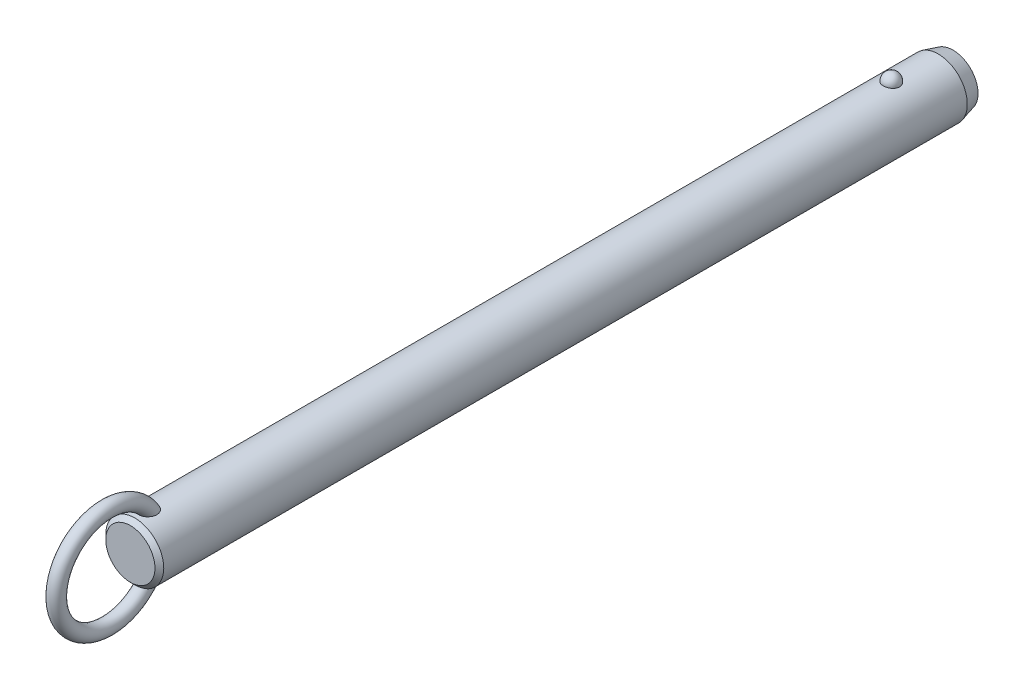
ISO-10303-21;
HEADER;
FILE_DESCRIPTION(('STEP AP214'),'2;1');
FILE_NAME('part.step','',(''),(''),'','','');
FILE_SCHEMA(('AUTOMOTIVE_DESIGN { 1 0 10303 214 1 1 1 1 }'));
ENDSEC;
DATA;
#1=APPLICATION_CONTEXT('core data for automotive mechanical design processes');
#2=APPLICATION_PROTOCOL_DEFINITION('international standard','automotive_design',2000,#1);
#3=PRODUCT_CONTEXT('',#1,'mechanical');
#4=PRODUCT('Part','Part','',(#3));
#5=PRODUCT_RELATED_PRODUCT_CATEGORY('part','',(#4));
#6=PRODUCT_DEFINITION_FORMATION('','',#4);
#7=PRODUCT_DEFINITION_CONTEXT('part definition',#1,'design');
#8=PRODUCT_DEFINITION('design','',#6,#7);
#9=PRODUCT_DEFINITION_SHAPE('','',#8);
#10=(LENGTH_UNIT() NAMED_UNIT(*) SI_UNIT(.MILLI.,.METRE.));
#11=(NAMED_UNIT(*) PLANE_ANGLE_UNIT() SI_UNIT($,.RADIAN.));
#12=(NAMED_UNIT(*) SI_UNIT($,.STERADIAN.) SOLID_ANGLE_UNIT());
#13=UNCERTAINTY_MEASURE_WITH_UNIT(LENGTH_MEASURE(1.E-05),#10,'distance_accuracy_value','');
#14=(GEOMETRIC_REPRESENTATION_CONTEXT(3) GLOBAL_UNCERTAINTY_ASSIGNED_CONTEXT((#13)) GLOBAL_UNIT_ASSIGNED_CONTEXT((#10,
#11,#12)) REPRESENTATION_CONTEXT('',''));
#15=CARTESIAN_POINT('',(0.,0.,0.));
#16=DIRECTION('',(0.,0.,1.));
#17=DIRECTION('',(1.,0.,0.));
#18=AXIS2_PLACEMENT_3D('',#15,#16,#17);
#19=CARTESIAN_POINT('',(0.,0.,195.6));
#20=DIRECTION('',(0.,0.,-1.));
#21=DIRECTION('',(-1.,0.,0.));
#22=AXIS2_PLACEMENT_3D('',#19,#20,#21);
#23=CYLINDRICAL_SURFACE('',#22,7.9);
#24=CARTESIAN_POINT('',(2.1785689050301,7.59367088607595,-2.20000000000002));
#25=CARTESIAN_POINT('',(2.17856679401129,7.59367269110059,-2.07701843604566));
#26=CARTESIAN_POINT('',(2.16853481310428,7.59657145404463,-1.95401006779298));
#27=CARTESIAN_POINT('',(2.12864689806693,7.607843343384,-1.71147811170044));
#28=CARTESIAN_POINT('',(2.09878338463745,7.61621856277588,-1.5919558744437));
#29=CARTESIAN_POINT('',(2.0199931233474,7.63749180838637,-1.35985638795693));
#30=CARTESIAN_POINT('',(1.97107475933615,7.6503878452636,-1.24727610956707));
#31=CARTESIAN_POINT('',(1.85539377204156,7.67926115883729,-1.03213234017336));
#32=CARTESIAN_POINT('',(1.78863158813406,7.69523835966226,-0.929568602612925));
#33=CARTESIAN_POINT('',(1.63856494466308,7.7285848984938,-0.73678633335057));
#34=CARTESIAN_POINT('',(1.55518140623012,7.7459606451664,-0.646630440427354));
#35=CARTESIAN_POINT('',(1.37422937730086,7.78009978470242,-0.481747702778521));
#36=CARTESIAN_POINT('',(1.27666086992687,7.79686317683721,-0.407020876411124));
#37=CARTESIAN_POINT('',(1.07024728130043,7.82786153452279,-0.275278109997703));
#38=CARTESIAN_POINT('',(0.961434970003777,7.84210353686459,-0.218212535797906));
#39=CARTESIAN_POINT('',(0.735351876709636,7.86652194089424,-0.123146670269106));
#40=CARTESIAN_POINT('',(0.618082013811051,7.87669878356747,-0.0851443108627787));
#41=CARTESIAN_POINT('',(0.380637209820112,7.89170521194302,-0.0298158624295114));
#42=CARTESIAN_POINT('',(0.260550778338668,7.89662650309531,-0.0121347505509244));
#43=CARTESIAN_POINT('',(0.0190117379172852,7.90090003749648,0.00324379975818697));
#44=CARTESIAN_POINT('',(-0.102440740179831,7.90025280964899,0.000943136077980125));
#45=CARTESIAN_POINT('',(-0.341452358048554,7.89351056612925,-0.0233955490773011));
#46=CARTESIAN_POINT('',(-0.459042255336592,7.88749257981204,-0.0451545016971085));
#47=CARTESIAN_POINT('',(-0.688796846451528,7.87075812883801,-0.107408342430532));
#48=CARTESIAN_POINT('',(-0.800961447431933,7.86004158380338,-0.14790355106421));
#49=CARTESIAN_POINT('',(-1.01743634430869,7.83497131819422,-0.246799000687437));
#50=CARTESIAN_POINT('',(-1.12169791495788,7.82059709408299,-0.305300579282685));
#51=CARTESIAN_POINT('',(-1.31891765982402,7.78976470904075,-0.43854939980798));
#52=CARTESIAN_POINT('',(-1.41187469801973,7.77330633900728,-0.513298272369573));
#53=CARTESIAN_POINT('',(-1.58577142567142,7.73972434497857,-0.678622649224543));
#54=CARTESIAN_POINT('',(-1.66645140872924,7.72259402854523,-0.769470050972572));
#55=CARTESIAN_POINT('',(-1.81161503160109,7.68983776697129,-0.963538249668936));
#56=CARTESIAN_POINT('',(-1.87609753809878,7.6742119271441,-1.0667599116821));
#57=CARTESIAN_POINT('',(-1.98790138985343,7.6460202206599,-1.28401170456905));
#58=CARTESIAN_POINT('',(-2.03501994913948,7.63349104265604,-1.39815107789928));
#59=CARTESIAN_POINT('',(-2.10986724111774,7.6131449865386,-1.6330178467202));
#60=CARTESIAN_POINT('',(-2.1375965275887,7.60532797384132,-1.75374505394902));
#61=CARTESIAN_POINT('',(-2.17289256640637,7.5953195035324,-1.99782562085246));
#62=CARTESIAN_POINT('',(-2.18054294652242,7.59310471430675,-2.12116592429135));
#63=CARTESIAN_POINT('',(-2.17572919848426,7.59448538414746,-2.36741799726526));
#64=CARTESIAN_POINT('',(-2.1632656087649,7.59808068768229,-2.49032977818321));
#65=CARTESIAN_POINT('',(-2.11865035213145,7.61064035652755,-2.73161015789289));
#66=CARTESIAN_POINT('',(-2.08659579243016,7.61957823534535,-2.84999812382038));
#67=CARTESIAN_POINT('',(-2.00367799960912,7.64179982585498,-3.07955956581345));
#68=CARTESIAN_POINT('',(-1.9528140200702,7.65508371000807,-3.19073275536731));
#69=CARTESIAN_POINT('',(-1.83321113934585,7.68460381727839,-3.40337899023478));
#70=CARTESIAN_POINT('',(-1.76437735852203,7.70085556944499,-3.5047965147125));
#71=CARTESIAN_POINT('',(-1.61069526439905,7.73445734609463,-3.69446912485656));
#72=CARTESIAN_POINT('',(-1.52584634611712,7.75180741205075,-3.78272371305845));
#73=CARTESIAN_POINT('',(-1.34198059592,7.78574608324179,-3.94393987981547));
#74=CARTESIAN_POINT('',(-1.24291308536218,7.80233167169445,-4.01684434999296));
#75=CARTESIAN_POINT('',(-1.03352039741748,7.83281625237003,-4.14489386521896));
#76=CARTESIAN_POINT('',(-0.92319600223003,7.84671543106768,-4.20004014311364));
#77=CARTESIAN_POINT('',(-0.695822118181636,7.87011575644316,-4.29042017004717));
#78=CARTESIAN_POINT('',(-0.578872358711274,7.87966903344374,-4.32589112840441));
#79=CARTESIAN_POINT('',(-0.340410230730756,7.8935652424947,-4.37692226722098));
#80=CARTESIAN_POINT('',(-0.218898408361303,7.89790879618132,-4.39248482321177));
#81=CARTESIAN_POINT('',(0.0228107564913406,7.90087453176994,-4.40314405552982));
#82=CARTESIAN_POINT('',(0.142990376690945,7.89960185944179,-4.39861683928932));
#83=CARTESIAN_POINT('',(0.380829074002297,7.89171262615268,-4.37008293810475));
#84=CARTESIAN_POINT('',(0.498488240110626,7.8850962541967,-4.34607694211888));
#85=CARTESIAN_POINT('',(0.727535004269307,7.86726442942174,-4.27939317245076));
#86=CARTESIAN_POINT('',(0.838944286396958,7.85606616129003,-4.23678512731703));
#87=CARTESIAN_POINT('',(1.05295421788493,7.83025654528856,-4.13408348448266));
#88=CARTESIAN_POINT('',(1.15555431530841,7.81564498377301,-4.07398879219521));
#89=CARTESIAN_POINT('',(1.35076763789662,7.7843022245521,-3.93687432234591));
#90=CARTESIAN_POINT('',(1.4432046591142,7.76754209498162,-3.85961036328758));
#91=CARTESIAN_POINT('',(1.6139111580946,7.73387857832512,-3.69076949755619));
#92=CARTESIAN_POINT('',(1.6921781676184,7.71697516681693,-3.59919010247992));
#93=CARTESIAN_POINT('',(1.83380875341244,7.6845643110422,-3.40247278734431));
#94=CARTESIAN_POINT('',(1.89689280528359,7.66908588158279,-3.29712873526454));
#95=CARTESIAN_POINT('',(2.0047823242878,7.64159441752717,-3.07707931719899));
#96=CARTESIAN_POINT('',(2.0495945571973,7.62958010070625,-2.96237743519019));
#97=CARTESIAN_POINT('',(2.11580183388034,7.61146617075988,-2.74040519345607));
#98=CARTESIAN_POINT('',(2.13929812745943,7.60484503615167,-2.63379846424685));
#99=CARTESIAN_POINT('',(2.17068242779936,7.59594664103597,-2.4181348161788));
#100=CARTESIAN_POINT('',(2.17857077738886,7.59366928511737,-2.30907795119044));
#101=CARTESIAN_POINT('',(2.1785689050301,7.59367088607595,-2.20000000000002));
#102=B_SPLINE_CURVE_WITH_KNOTS('',3,(#24,#25,#26,#27,#28,#29,#30,#31,#32,#33,#34,#35,#36,#37,
#38,#39,#40,#41,#42,#43,#44,#45,#46,#47,#48,#49,#50,#51,#52,#53,#54,#55,#56,#57,#58,#59,#60,#61,
#62,#63,#64,#65,#66,#67,#68,#69,#70,#71,#72,#73,#74,#75,#76,#77,#78,#79,#80,#81,#82,#83,#84,#85,
#86,#87,#88,#89,#90,#91,#92,#93,#94,#95,#96,#97,#98,#99,#100,#101),.UNSPECIFIED.,.T.,.F.,(4,2,2,
2,2,2,2,2,2,2,2,2,2,2,2,2,2,2,2,2,2,2,2,2,2,2,2,2,2,2,2,2,2,2,2,2,2,2,4),(0.,0.368552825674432,
0.737246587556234,1.10577831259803,1.4743009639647,1.8446206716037,2.21494081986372,
2.5842105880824,2.95344028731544,3.31611630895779,3.67875788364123,4.03628044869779,
4.39380913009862,4.75338791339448,5.11300280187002,5.47939989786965,5.8458226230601,
6.21639834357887,6.58696347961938,6.95598276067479,7.32499216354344,7.69218715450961,
8.0593967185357,8.42858578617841,8.79778880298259,9.16834203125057,9.5388695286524,
9.90482699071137,10.2707407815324,10.6298333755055,10.9889132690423,11.3466585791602,
11.7044262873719,12.0676511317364,12.4309391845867,12.8004764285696,13.1698767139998,
13.4967701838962,13.8236564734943),.UNSPECIFIED.);
#103=CARTESIAN_POINT('',(2.1785689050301,7.59367088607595,-2.20000000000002));
#104=VERTEX_POINT('',#103);
#105=EDGE_CURVE('E41',#104,#104,#102,.T.);
#106=ORIENTED_EDGE('',*,*,#105,.T.);
#107=EDGE_LOOP('',(#106));
#108=FACE_BOUND('',#107,.T.);
#109=CARTESIAN_POINT('',(0.,0.,203.92));
#110=DIRECTION('',(0.,0.,1.));
#111=DIRECTION('',(1.,0.,0.));
#112=AXIS2_PLACEMENT_3D('',#109,#110,#111);
#113=CIRCLE('',#112,7.9);
#114=CARTESIAN_POINT('',(7.9,0.,203.92));
#115=VERTEX_POINT('',#114);
#116=EDGE_CURVE('E10',#115,#115,#113,.F.);
#117=ORIENTED_EDGE('',*,*,#116,.T.);
#118=EDGE_LOOP('',(#117));
#119=FACE_BOUND('',#118,.T.);
#120=CARTESIAN_POINT('',(-0.630969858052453,-7.87476203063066,197.812432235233));
#121=CARTESIAN_POINT('',(-0.734180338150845,-7.86648998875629,197.847285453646));
#122=CARTESIAN_POINT('',(-0.83447695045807,-7.85639291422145,197.890816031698));
#123=CARTESIAN_POINT('',(-1.0262035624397,-7.83366343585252,197.994094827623));
#124=CARTESIAN_POINT('',(-1.1176141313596,-7.82102565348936,198.053877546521));
#125=CARTESIAN_POINT('',(-1.28877277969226,-7.79464922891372,198.187839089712));
#126=CARTESIAN_POINT('',(-1.36854014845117,-7.78091246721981,198.261993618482));
#127=CARTESIAN_POINT('',(-1.51461521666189,-7.75380398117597,198.422494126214));
#128=CARTESIAN_POINT('',(-1.58092966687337,-7.74043207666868,198.508833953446));
#129=CARTESIAN_POINT('',(-1.70019064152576,-7.7151252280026,198.692978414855));
#130=CARTESIAN_POINT('',(-1.75284037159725,-7.70322473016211,198.790979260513));
#131=CARTESIAN_POINT('',(-1.84263464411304,-7.68224112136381,198.994102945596));
#132=CARTESIAN_POINT('',(-1.87977299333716,-7.6731591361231,199.099228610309));
#133=CARTESIAN_POINT('',(-1.94152728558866,-7.65777930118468,199.323284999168));
#134=CARTESIAN_POINT('',(-1.96475471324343,-7.65179654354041,199.442616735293));
#135=CARTESIAN_POINT('',(-1.99449499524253,-7.64409642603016,199.68342986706));
#136=CARTESIAN_POINT('',(-2.0010005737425,-7.64238092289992,199.804912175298));
#137=CARTESIAN_POINT('',(-1.99856014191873,-7.64302120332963,200.068340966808));
#138=CARTESIAN_POINT('',(-1.98680021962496,-7.64611845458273,200.21025654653));
#139=CARTESIAN_POINT('',(-1.94457772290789,-7.65696186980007,200.491118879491));
#140=CARTESIAN_POINT('',(-1.91409393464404,-7.66471330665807,200.630062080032));
#141=CARTESIAN_POINT('',(-1.82768670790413,-7.68582947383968,200.931939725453));
#142=CARTESIAN_POINT('',(-1.76772963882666,-7.70003779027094,201.093686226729));
#143=CARTESIAN_POINT('',(-1.65998501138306,-7.72371550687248,201.327695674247));
#144=CARTESIAN_POINT('',(-1.62107967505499,-7.73200670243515,201.404297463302));
#145=CARTESIAN_POINT('',(-1.53727726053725,-7.7491037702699,201.554079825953));
#146=CARTESIAN_POINT('',(-1.49238215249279,-7.75790947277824,201.627261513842));
#147=CARTESIAN_POINT('',(-1.37397050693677,-7.77993338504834,201.80288382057));
#148=CARTESIAN_POINT('',(-1.29690364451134,-7.79328473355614,201.902955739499));
#149=CARTESIAN_POINT('',(-1.12885487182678,-7.81939266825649,202.090714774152));
#150=CARTESIAN_POINT('',(-1.03789926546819,-7.83215032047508,202.178424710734));
#151=CARTESIAN_POINT('',(-0.869532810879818,-7.85231710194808,202.313414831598));
#152=CARTESIAN_POINT('',(-0.795716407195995,-7.86021093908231,202.365076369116));
#153=CARTESIAN_POINT('',(-0.640813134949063,-7.87434920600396,202.456381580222));
#154=CARTESIAN_POINT('',(-0.559737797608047,-7.88059619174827,202.49604389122));
#155=CARTESIAN_POINT('',(-0.406456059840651,-7.88984116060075,202.554300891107));
#156=CARTESIAN_POINT('',(-0.335227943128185,-7.89321892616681,202.575384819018));
#157=CARTESIAN_POINT('',(-0.190193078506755,-7.89804235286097,202.60541418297));
#158=CARTESIAN_POINT('',(-0.116388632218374,-7.89948969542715,202.614370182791));
#159=CARTESIAN_POINT('',(0.0318414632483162,-7.90028409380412,202.619291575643));
#160=CARTESIAN_POINT('',(0.106268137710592,-7.89962640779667,202.615227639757));
#161=CARTESIAN_POINT('',(0.253290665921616,-7.8962818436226,202.594461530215));
#162=CARTESIAN_POINT('',(0.325885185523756,-7.8935935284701,202.577750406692));
#163=CARTESIAN_POINT('',(0.481441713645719,-7.88577340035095,202.528738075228));
#164=CARTESIAN_POINT('',(0.563611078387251,-7.88026321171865,202.494005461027));
#165=CARTESIAN_POINT('',(0.721129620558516,-7.86741729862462,202.411796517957));
#166=CARTESIAN_POINT('',(0.79646633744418,-7.86007832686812,202.364297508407));
#167=CARTESIAN_POINT('',(0.971456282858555,-7.84073285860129,202.236513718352));
#168=CARTESIAN_POINT('',(1.06719686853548,-7.82809461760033,202.151004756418));
#169=CARTESIAN_POINT('',(1.24418921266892,-7.80192439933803,201.966232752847));
#170=CARTESIAN_POINT('',(1.32540832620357,-7.78839049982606,201.866939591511));
#171=CARTESIAN_POINT('',(1.45199971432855,-7.76559693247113,201.689576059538));
#172=CARTESIAN_POINT('',(1.50085649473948,-7.75626094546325,201.613954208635));
#173=CARTESIAN_POINT('',(1.59197749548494,-7.73807279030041,201.458742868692));
#174=CARTESIAN_POINT('',(1.63423919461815,-7.72922080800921,201.379151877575));
#175=CARTESIAN_POINT('',(1.71222612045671,-7.71231959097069,201.216664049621));
#176=CARTESIAN_POINT('',(1.74794516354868,-7.70427111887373,201.133764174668));
#177=CARTESIAN_POINT('',(1.81270113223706,-7.68929240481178,200.965296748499));
#178=CARTESIAN_POINT('',(1.84173789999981,-7.68236218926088,200.879729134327));
#179=CARTESIAN_POINT('',(1.89322698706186,-7.6698375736,200.70528702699));
#180=CARTESIAN_POINT('',(1.91558744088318,-7.66426199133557,200.616383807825));
#181=CARTESIAN_POINT('',(1.95281367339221,-7.65485915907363,200.436969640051));
#182=CARTESIAN_POINT('',(1.96767946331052,-7.65103190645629,200.346458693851));
#183=CARTESIAN_POINT('',(2.0002145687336,-7.64262981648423,200.073732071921));
#184=CARTESIAN_POINT('',(2.00600691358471,-7.6410871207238,199.889709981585));
#185=CARTESIAN_POINT('',(1.98445334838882,-7.64669564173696,199.576501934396));
#186=CARTESIAN_POINT('',(1.96607186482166,-7.65149688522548,199.446618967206));
#187=CARTESIAN_POINT('',(1.90884967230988,-7.66597624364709,199.191632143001));
#188=CARTESIAN_POINT('',(1.87002101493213,-7.67565148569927,199.066525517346));
#189=CARTESIAN_POINT('',(1.77063986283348,-7.69918471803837,198.82454013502));
#190=CARTESIAN_POINT('',(1.70993724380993,-7.71307150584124,198.707725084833));
#191=CARTESIAN_POINT('',(1.56733070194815,-7.74330306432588,198.488144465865));
#192=CARTESIAN_POINT('',(1.48543692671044,-7.75964665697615,198.385372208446));
#193=CARTESIAN_POINT('',(1.31346177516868,-7.79047523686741,198.209380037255));
#194=CARTESIAN_POINT('',(1.22547278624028,-7.80495298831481,198.134106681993));
#195=CARTESIAN_POINT('',(1.03724352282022,-7.83218597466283,198.000486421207));
#196=CARTESIAN_POINT('',(0.93700840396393,-7.84494192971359,197.942132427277));
#197=CARTESIAN_POINT('',(0.733599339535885,-7.86649045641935,197.847027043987));
#198=CARTESIAN_POINT('',(0.630941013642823,-7.87547134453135,197.809210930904));
#199=CARTESIAN_POINT('',(0.420465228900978,-7.88950708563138,197.751116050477));
#200=CARTESIAN_POINT('',(0.312645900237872,-7.89456050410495,197.73084369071));
#201=CARTESIAN_POINT('',(0.0960869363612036,-7.9001518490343,197.708455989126));
#202=CARTESIAN_POINT('',(-0.0126341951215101,-7.90073226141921,197.706169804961));
#203=CARTESIAN_POINT('',(-0.228766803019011,-7.89742350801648,197.719367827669));
#204=CARTESIAN_POINT('',(-0.336180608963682,-7.89354403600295,197.734813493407));
#205=CARTESIAN_POINT('',(-0.473410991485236,-7.88586871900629,197.766217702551));
#206=CARTESIAN_POINT('',(-0.50525779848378,-7.88388984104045,197.774354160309));
#207=CARTESIAN_POINT('',(-0.56848128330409,-7.87958326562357,197.792208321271));
#208=CARTESIAN_POINT('',(-0.59985795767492,-7.87725556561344,197.801926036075));
#209=CARTESIAN_POINT('',(-0.630969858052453,-7.87476203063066,197.812432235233));
#210=B_SPLINE_CURVE_WITH_KNOTS('',3,(#120,#121,#122,#123,#124,#125,#126,#127,#128,#129,#130,
#131,#132,#133,#134,#135,#136,#137,#138,#139,#140,#141,#142,#143,#144,#145,#146,#147,#148,#149,
#150,#151,#152,#153,#154,#155,#156,#157,#158,#159,#160,#161,#162,#163,#164,#165,#166,#167,#168,
#169,#170,#171,#172,#173,#174,#175,#176,#177,#178,#179,#180,#181,#182,#183,#184,#185,#186,#187,
#188,#189,#190,#191,#192,#193,#194,#195,#196,#197,#198,#199,#200,#201,#202,#203,#204,#205,#206,
#207,#208,#209),.UNSPECIFIED.,.T.,.F.,(4,2,2,2,2,2,2,2,2,2,2,2,2,2,2,2,2,2,2,2,2,2,2,2,2,2,2,2,
2,2,2,2,2,2,2,2,2,2,2,2,2,2,2,2,4),(0.,0.327622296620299,0.655945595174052,0.983718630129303,
1.3113267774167,1.6455465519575,1.97989964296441,2.34365728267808,2.70757317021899,
3.13333684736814,3.5595838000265,4.07655306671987,4.33527897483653,4.59391999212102,
4.97382437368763,5.353017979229,5.62348245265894,5.89352465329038,6.11565959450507,
6.33760092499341,6.56004255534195,6.78264174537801,7.04930844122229,7.31645206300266,
7.70130871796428,8.08701995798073,8.35824509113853,8.6295736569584,8.9011573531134,
9.1727474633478,9.44791855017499,9.72308922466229,10.2715298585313,10.6638393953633,
11.0559179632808,11.4507403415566,11.8453740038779,12.1936425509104,12.5417649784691,
12.8695063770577,13.1973674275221,13.5221104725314,13.8461490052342,13.9449071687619,
14.0436660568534),.UNSPECIFIED.);
#211=CARTESIAN_POINT('',(-0.630969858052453,-7.87476203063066,197.812432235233));
#212=VERTEX_POINT('',#211);
#213=EDGE_CURVE('E59',#212,#212,#210,.T.);
#214=ORIENTED_EDGE('',*,*,#213,.T.);
#215=EDGE_LOOP('',(#214));
#216=FACE_BOUND('',#215,.T.);
#217=CARTESIAN_POINT('',(-0.630969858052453,7.87476203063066,197.812432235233));
#218=CARTESIAN_POINT('',(-0.528918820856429,7.88293636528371,197.777979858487));
#219=CARTESIAN_POINT('',(-0.423745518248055,7.88934810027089,197.751915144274));
#220=CARTESIAN_POINT('',(-0.210236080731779,7.8979273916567,197.717282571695));
#221=CARTESIAN_POINT('',(-0.10189380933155,7.90008607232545,197.708751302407));
#222=CARTESIAN_POINT('',(0.11466056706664,7.89990877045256,197.709457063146));
#223=CARTESIAN_POINT('',(0.222872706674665,7.89757640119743,197.71867980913));
#224=CARTESIAN_POINT('',(0.436107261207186,7.88867538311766,197.754652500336));
#225=CARTESIAN_POINT('',(0.54113114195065,7.8821087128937,197.78139425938));
#226=CARTESIAN_POINT('',(0.745085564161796,7.86545130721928,197.851756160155));
#227=CARTESIAN_POINT('',(0.844015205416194,7.85536005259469,197.895378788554));
#228=CARTESIAN_POINT('',(1.03299167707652,7.83275153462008,197.998379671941));
#229=CARTESIAN_POINT('',(1.12303841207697,7.8202342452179,198.057758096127));
#230=CARTESIAN_POINT('',(1.29214734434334,7.79408219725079,198.190864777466));
#231=CARTESIAN_POINT('',(1.37116907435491,7.78044359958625,198.264643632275));
#232=CARTESIAN_POINT('',(1.51597677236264,7.75353170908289,198.424235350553));
#233=CARTESIAN_POINT('',(1.58176261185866,7.74025841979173,198.510048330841));
#234=CARTESIAN_POINT('',(1.70057386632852,7.71504069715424,198.693644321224));
#235=CARTESIAN_POINT('',(1.75320073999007,7.7031425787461,198.791690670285));
#236=CARTESIAN_POINT('',(1.8429376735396,7.68216822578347,198.994893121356));
#237=CARTESIAN_POINT('',(1.88004278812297,7.67309289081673,199.100051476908));
#238=CARTESIAN_POINT('',(1.9417232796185,7.6577294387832,199.324167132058));
#239=CARTESIAN_POINT('',(1.96491037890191,7.65175648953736,199.443524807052));
#240=CARTESIAN_POINT('',(1.9945689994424,7.64407702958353,199.684384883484));
#241=CARTESIAN_POINT('',(2.00103304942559,7.64237242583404,199.80588821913));
#242=CARTESIAN_POINT('',(1.99850166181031,7.64303650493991,200.069368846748));
#243=CARTESIAN_POINT('',(1.98669038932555,7.64614714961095,200.211314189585));
#244=CARTESIAN_POINT('',(1.94436120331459,7.65701701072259,200.492228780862));
#245=CARTESIAN_POINT('',(1.91382203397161,7.66478150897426,200.631194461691));
#246=CARTESIAN_POINT('',(1.82728754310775,7.68592483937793,200.933111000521));
#247=CARTESIAN_POINT('',(1.76725778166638,7.70014685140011,201.094872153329));
#248=CARTESIAN_POINT('',(1.65939700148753,7.72384204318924,201.328891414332));
#249=CARTESIAN_POINT('',(1.62045187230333,7.73213852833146,201.405494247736));
#250=CARTESIAN_POINT('',(1.5365668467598,7.74924489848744,201.555273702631));
#251=CARTESIAN_POINT('',(1.49162892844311,7.75805461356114,201.628451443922));
#252=CARTESIAN_POINT('',(1.37317698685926,7.78007342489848,201.803952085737));
#253=CARTESIAN_POINT('',(1.29612360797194,7.79341423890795,201.903911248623));
#254=CARTESIAN_POINT('',(1.12812043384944,7.81949839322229,202.09145083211));
#255=CARTESIAN_POINT('',(1.03719688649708,7.83224280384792,202.179054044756));
#256=CARTESIAN_POINT('',(0.868871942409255,7.85239026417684,202.31389715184));
#257=CARTESIAN_POINT('',(0.795056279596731,7.86027769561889,202.365511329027));
#258=CARTESIAN_POINT('',(0.640160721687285,7.87440222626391,202.456720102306));
#259=CARTESIAN_POINT('',(0.559092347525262,7.88064188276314,202.496333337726));
#260=CARTESIAN_POINT('',(0.405820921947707,7.8898738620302,202.554505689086));
#261=CARTESIAN_POINT('',(0.334594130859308,7.89324577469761,202.575552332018));
#262=CARTESIAN_POINT('',(0.189568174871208,7.89805733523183,202.605507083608));
#263=CARTESIAN_POINT('',(0.115771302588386,7.89949866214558,202.614425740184));
#264=CARTESIAN_POINT('',(-0.0324359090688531,7.90028156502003,202.61927589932));
#265=CARTESIAN_POINT('',(-0.106847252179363,7.89961843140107,202.615178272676));
#266=CARTESIAN_POINT('',(-0.253834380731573,7.8962642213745,202.594351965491));
#267=CARTESIAN_POINT('',(-0.326408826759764,7.89357170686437,202.577614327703));
#268=CARTESIAN_POINT('',(-0.481962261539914,7.88574179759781,202.528539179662));
#269=CARTESIAN_POINT('',(-0.564145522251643,7.88022507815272,202.493763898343));
#270=CARTESIAN_POINT('',(-0.721685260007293,7.86736646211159,202.411468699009));
#271=CARTESIAN_POINT('',(-0.797029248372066,7.8600213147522,202.363926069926));
#272=CARTESIAN_POINT('',(-0.9720442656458,7.84066026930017,202.236026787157));
#273=CARTESIAN_POINT('',(-1.06779803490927,7.82801274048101,202.150443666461));
#274=CARTESIAN_POINT('',(-1.2448053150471,7.80182621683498,201.965522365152));
#275=CARTESIAN_POINT('',(-1.32602618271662,7.78828530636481,201.866154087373));
#276=CARTESIAN_POINT('',(-1.45259834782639,7.76548487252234,201.688680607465));
#277=CARTESIAN_POINT('',(-1.50143856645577,7.75614818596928,201.613025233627));
#278=CARTESIAN_POINT('',(-1.59252410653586,7.73796020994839,201.457748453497));
#279=CARTESIAN_POINT('',(-1.63476690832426,7.72910910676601,201.378125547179));
#280=CARTESIAN_POINT('',(-1.71271318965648,7.71221133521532,201.215575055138));
#281=CARTESIAN_POINT('',(-1.74841047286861,7.70416543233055,201.132644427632));
#282=CARTESIAN_POINT('',(-1.81311929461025,7.6891937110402,200.964116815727));
#283=CARTESIAN_POINT('',(-1.84213067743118,7.68226791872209,200.878519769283));
#284=CARTESIAN_POINT('',(-1.89356259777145,7.66975461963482,200.704025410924));
#285=CARTESIAN_POINT('',(-1.91589165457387,7.66418586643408,200.615099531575));
#286=CARTESIAN_POINT('',(-1.9530507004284,7.65479859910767,200.435642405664));
#287=CARTESIAN_POINT('',(-1.96788069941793,7.65098008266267,200.345111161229));
#288=CARTESIAN_POINT('',(-2.00030078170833,7.64260704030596,200.072327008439));
#289=CARTESIAN_POINT('',(-2.00600576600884,7.64108760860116,199.888271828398));
#290=CARTESIAN_POINT('',(-1.9842848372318,7.64673945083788,199.575080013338));
#291=CARTESIAN_POINT('',(-1.96583698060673,7.65155751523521,199.445240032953));
#292=CARTESIAN_POINT('',(-1.90848948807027,7.66606613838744,199.190361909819));
#293=CARTESIAN_POINT('',(-1.86960376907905,7.67575338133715,199.065320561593));
#294=CARTESIAN_POINT('',(-1.77013421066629,7.6993013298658,198.823500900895));
#295=CARTESIAN_POINT('',(-1.70940488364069,7.71318991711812,198.706784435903));
#296=CARTESIAN_POINT('',(-1.56672953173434,7.74342495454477,198.487340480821));
#297=CARTESIAN_POINT('',(-1.48478316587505,7.75977144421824,198.38461321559));
#298=CARTESIAN_POINT('',(-1.31266325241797,7.79061163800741,198.208643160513));
#299=CARTESIAN_POINT('',(-1.22456383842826,7.80509908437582,198.133358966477));
#300=CARTESIAN_POINT('',(-1.03622400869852,7.83231881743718,197.999865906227));
#301=CARTESIAN_POINT('',(-0.936015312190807,7.84505551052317,197.941613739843));
#302=CARTESIAN_POINT('',(-0.798824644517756,7.85957802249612,197.877540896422));
#303=CARTESIAN_POINT('',(-0.765787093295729,7.86286821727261,197.863224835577));
#304=CARTESIAN_POINT('',(-0.698939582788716,7.86909211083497,197.836436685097));
#305=CARTESIAN_POINT('',(-0.66512963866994,7.8720258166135,197.823964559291));
#306=CARTESIAN_POINT('',(-0.630969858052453,7.87476203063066,197.812432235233));
#307=B_SPLINE_CURVE_WITH_KNOTS('',3,(#217,#218,#219,#220,#221,#222,#223,#224,#225,#226,#227,
#228,#229,#230,#231,#232,#233,#234,#235,#236,#237,#238,#239,#240,#241,#242,#243,#244,#245,#246,
#247,#248,#249,#250,#251,#252,#253,#254,#255,#256,#257,#258,#259,#260,#261,#262,#263,#264,#265,
#266,#267,#268,#269,#270,#271,#272,#273,#274,#275,#276,#277,#278,#279,#280,#281,#282,#283,#284,
#285,#286,#287,#288,#289,#290,#291,#292,#293,#294,#295,#296,#297,#298,#299,#300,#301,#302,#303,
#304,#305,#306),.UNSPECIFIED.,.T.,.F.,(4,2,2,2,2,2,2,2,2,2,2,2,2,2,2,2,2,2,2,2,2,2,2,2,2,2,2,2,
2,2,2,2,2,2,2,2,2,2,2,2,2,2,2,2,4),(0.,0.323920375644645,0.648516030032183,0.972850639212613,
1.29703380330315,1.62126473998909,1.94549915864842,2.27089401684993,2.5962920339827,
2.93059633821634,3.26500707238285,3.6288164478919,3.99278833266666,4.4186542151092,
4.84500434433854,5.36209210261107,5.62087589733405,5.87957448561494,6.25918598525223,
6.63808782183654,6.90846748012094,7.17842501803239,7.40052350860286,7.6224287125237,
7.84483086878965,8.06739077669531,8.33414615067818,8.60137921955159,8.98641454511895,
9.37230415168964,9.64358673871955,9.91497268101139,10.1866142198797,10.4582620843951,
10.7334745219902,11.008686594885,11.5572126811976,11.9494246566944,12.3413699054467,
12.7359755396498,13.1305875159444,13.4791770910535,13.82687259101,13.9353013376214,
14.0437279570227),.UNSPECIFIED.);
#308=CARTESIAN_POINT('',(-0.630969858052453,7.87476203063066,197.812432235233));
#309=VERTEX_POINT('',#308);
#310=EDGE_CURVE('E67',#309,#309,#307,.T.);
#311=ORIENTED_EDGE('',*,*,#310,.T.);
#312=EDGE_LOOP('',(#311));
#313=FACE_BOUND('',#312,.T.);
#314=CARTESIAN_POINT('',(0.,0.,-15.));
#315=DIRECTION('',(0.,0.,-1.));
#316=DIRECTION('',(-1.,0.,0.));
#317=AXIS2_PLACEMENT_3D('',#314,#315,#316);
#318=CIRCLE('',#317,7.9);
#319=CARTESIAN_POINT('',(-7.9,0.,-15.));
#320=VERTEX_POINT('',#319);
#321=EDGE_CURVE('E56',#320,#320,#318,.F.);
#322=ORIENTED_EDGE('',*,*,#321,.T.);
#323=EDGE_LOOP('',(#322));
#324=FACE_BOUND('',#323,.T.);
#325=ADVANCED_FACE('F37',(#108,#119,#216,#313,#324),#23,.T.);
#326=CARTESIAN_POINT('',(0.,0.,-19.));
#327=DIRECTION('',(0.,0.,-1.));
#328=DIRECTION('',(-1.,0.,0.));
#329=AXIS2_PLACEMENT_3D('',#326,#327,#328);
#330=PLANE('',#329);
#331=CARTESIAN_POINT('',(0.,0.,-19.));
#332=DIRECTION('',(0.,0.,-1.));
#333=DIRECTION('',(-1.,0.,0.));
#334=AXIS2_PLACEMENT_3D('',#331,#332,#333);
#335=CIRCLE('',#334,6.82820323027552);
#336=CARTESIAN_POINT('',(-6.82820323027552,0.,-19.));
#337=VERTEX_POINT('',#336);
#338=EDGE_CURVE('E66',#337,#337,#335,.T.);
#339=ORIENTED_EDGE('',*,*,#338,.T.);
#340=EDGE_LOOP('',(#339));
#341=FACE_BOUND('',#340,.T.);
#342=ADVANCED_FACE('F85',(#341),#330,.T.);
#343=CARTESIAN_POINT('',(0.,0.,-19.));
#344=DIRECTION('',(0.,0.,1.));
#345=DIRECTION('',(1.,0.,0.));
#346=AXIS2_PLACEMENT_3D('',#343,#344,#345);
#347=CONICAL_SURFACE('',#346,6.82820323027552,0.261799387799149);
#348=ORIENTED_EDGE('',*,*,#321,.F.);
#349=EDGE_LOOP('',(#348));
#350=FACE_BOUND('',#349,.T.);
#351=ORIENTED_EDGE('',*,*,#338,.F.);
#352=EDGE_LOOP('',(#351));
#353=FACE_BOUND('',#352,.T.);
#354=ADVANCED_FACE('F83',(#350,#353),#347,.T.);
#355=CARTESIAN_POINT('',(0.,0.,205.12));
#356=DIRECTION('',(0.,0.,1.));
#357=DIRECTION('',(1.,0.,0.));
#358=AXIS2_PLACEMENT_3D('',#355,#356,#357);
#359=PLANE('',#358);
#360=CARTESIAN_POINT('',(0.,0.,205.12));
#361=DIRECTION('',(0.,0.,1.));
#362=DIRECTION('',(1.,0.,0.));
#363=AXIS2_PLACEMENT_3D('',#360,#361,#362);
#364=CIRCLE('',#363,6.69999999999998);
#365=CARTESIAN_POINT('',(6.69999999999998,0.,205.12));
#366=VERTEX_POINT('',#365);
#367=EDGE_CURVE('E50',#366,#366,#364,.T.);
#368=ORIENTED_EDGE('',*,*,#367,.T.);
#369=EDGE_LOOP('',(#368));
#370=FACE_BOUND('',#369,.T.);
#371=ADVANCED_FACE('F77',(#370),#359,.T.);
#372=CARTESIAN_POINT('',(0.,0.,211.45));
#373=DIRECTION('',(1.,0.,0.));
#374=DIRECTION('',(0.,0.,-1.));
#375=AXIS2_PLACEMENT_3D('',#372,#373,#374);
#376=TOROIDAL_SURFACE('',#375,13.85,2.);
#377=ORIENTED_EDGE('',*,*,#310,.F.);
#378=EDGE_LOOP('',(#377));
#379=FACE_BOUND('',#378,.T.);
#380=ORIENTED_EDGE('',*,*,#213,.F.);
#381=EDGE_LOOP('',(#380));
#382=FACE_BOUND('',#381,.T.);
#383=ADVANCED_FACE('F73',(#379,#382),#376,.T.);
#384=CARTESIAN_POINT('',(0.,0.,205.12));
#385=DIRECTION('',(0.,0.,-1.));
#386=DIRECTION('',(-1.,0.,0.));
#387=AXIS2_PLACEMENT_3D('',#384,#385,#386);
#388=CONICAL_SURFACE('',#387,6.69999999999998,0.785398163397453);
#389=ORIENTED_EDGE('',*,*,#116,.F.);
#390=EDGE_LOOP('',(#389));
#391=FACE_BOUND('',#390,.T.);
#392=ORIENTED_EDGE('',*,*,#367,.F.);
#393=EDGE_LOOP('',(#392));
#394=FACE_BOUND('',#393,.T.);
#395=ADVANCED_FACE('F39',(#391,#394),#388,.T.);
#396=CARTESIAN_POINT('',(0.,7.9,-2.20000000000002));
#397=DIRECTION('',(0.,1.,0.));
#398=DIRECTION('',(0.,0.,1.));
#399=AXIS2_PLACEMENT_3D('',#396,#397,#398);
#400=SPHERICAL_SURFACE('',#399,2.2);
#401=ORIENTED_EDGE('',*,*,#105,.F.);
#402=EDGE_LOOP('',(#401));
#403=FACE_BOUND('',#402,.T.);
#404=ADVANCED_FACE('F79',(#403),#400,.T.);
#405=CLOSED_SHELL('',(#325,#342,#354,#371,#383,#395,#404));
#406=MANIFOLD_SOLID_BREP('B2',#405);
#407=ADVANCED_BREP_SHAPE_REPRESENTATION('',(#18,#406),#14);
#408=SHAPE_DEFINITION_REPRESENTATION(#9,#407);
ENDSEC;
END-ISO-10303-21;
